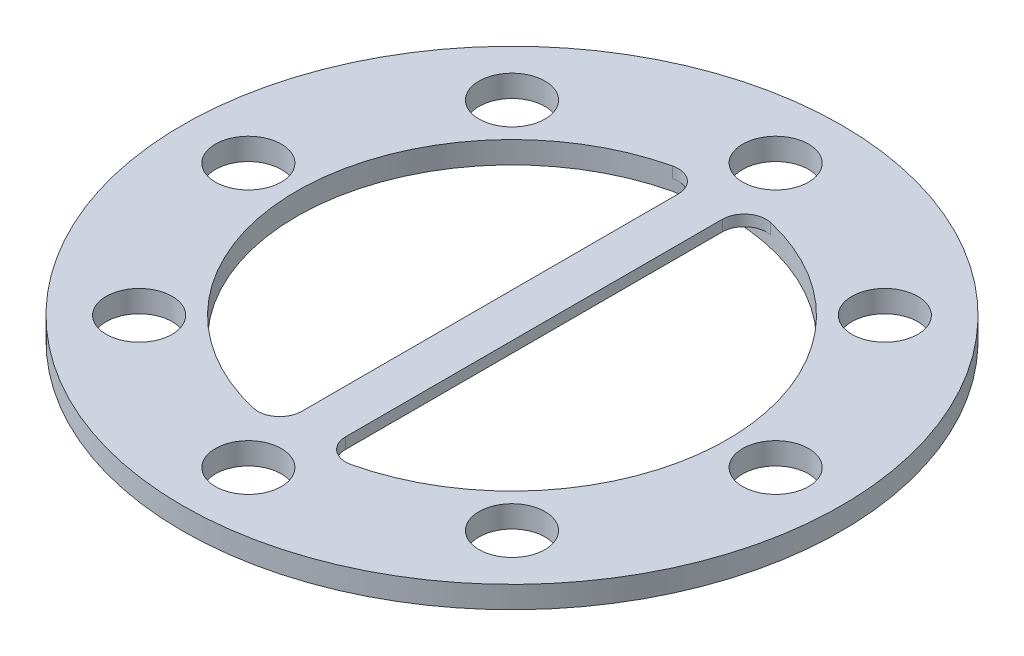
ISO-10303-21;
HEADER;
FILE_DESCRIPTION(('STEP AP214'),'2;1');
FILE_NAME('part.step','',(''),(''),'','','');
FILE_SCHEMA(('AUTOMOTIVE_DESIGN { 1 0 10303 214 1 1 1 1 }'));
ENDSEC;
DATA;
#1=APPLICATION_CONTEXT('core data for automotive mechanical design processes');
#2=APPLICATION_PROTOCOL_DEFINITION('international standard','automotive_design',2000,#1);
#3=PRODUCT_CONTEXT('',#1,'mechanical');
#4=PRODUCT('Part','Part','',(#3));
#5=PRODUCT_RELATED_PRODUCT_CATEGORY('part','',(#4));
#6=PRODUCT_DEFINITION_FORMATION('','',#4);
#7=PRODUCT_DEFINITION_CONTEXT('part definition',#1,'design');
#8=PRODUCT_DEFINITION('design','',#6,#7);
#9=PRODUCT_DEFINITION_SHAPE('','',#8);
#10=(LENGTH_UNIT() NAMED_UNIT(*) SI_UNIT(.MILLI.,.METRE.));
#11=(NAMED_UNIT(*) PLANE_ANGLE_UNIT() SI_UNIT($,.RADIAN.));
#12=(NAMED_UNIT(*) SI_UNIT($,.STERADIAN.) SOLID_ANGLE_UNIT());
#13=UNCERTAINTY_MEASURE_WITH_UNIT(LENGTH_MEASURE(1.E-05),#10,'distance_accuracy_value','');
#14=(GEOMETRIC_REPRESENTATION_CONTEXT(3) GLOBAL_UNCERTAINTY_ASSIGNED_CONTEXT((#13)) GLOBAL_UNIT_ASSIGNED_CONTEXT((#10,
#11,#12)) REPRESENTATION_CONTEXT('',''));
#15=CARTESIAN_POINT('',(0.,0.,0.));
#16=DIRECTION('',(0.,0.,1.));
#17=DIRECTION('',(1.,0.,0.));
#18=AXIS2_PLACEMENT_3D('',#15,#16,#17);
#19=CARTESIAN_POINT('',(0.,3.175,0.));
#20=DIRECTION('',(0.,-1.,0.));
#21=DIRECTION('',(0.,0.,-1.));
#22=AXIS2_PLACEMENT_3D('',#19,#20,#21);
#23=CYLINDRICAL_SURFACE('',#22,31.115);
#24=CARTESIAN_POINT('',(0.,1.5875,0.));
#25=DIRECTION('',(0.,1.,0.));
#26=DIRECTION('',(0.,0.,1.));
#27=AXIS2_PLACEMENT_3D('',#24,#25,#26);
#28=CIRCLE('',#27,31.115);
#29=CARTESIAN_POINT('',(7.07159090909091,1.5875,30.3007562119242));
#30=VERTEX_POINT('',#29);
#31=CARTESIAN_POINT('',(-7.07159090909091,1.5875,30.3007562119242));
#32=VERTEX_POINT('',#31);
#33=EDGE_CURVE('E156',#30,#32,#28,.F.);
#34=ORIENTED_EDGE('',*,*,#33,.F.);
#35=DIRECTION('',(0.,-1.,0.));
#36=VECTOR('',#35,1.);
#37=CARTESIAN_POINT('',(7.07159090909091,3.175,30.3007562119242));
#38=LINE('',#37,#36);
#39=CARTESIAN_POINT('',(7.07159090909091,3.175,30.3007562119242));
#40=VERTEX_POINT('',#39);
#41=EDGE_CURVE('E139',#30,#40,#38,.F.);
#42=ORIENTED_EDGE('',*,*,#41,.T.);
#43=CARTESIAN_POINT('',(0.,3.175,0.));
#44=DIRECTION('',(0.,1.,0.));
#45=DIRECTION('',(0.,0.,1.));
#46=AXIS2_PLACEMENT_3D('',#43,#44,#45);
#47=CIRCLE('',#46,31.115);
#48=CARTESIAN_POINT('',(7.07159090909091,3.175,-30.3007562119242));
#49=VERTEX_POINT('',#48);
#50=EDGE_CURVE('E153',#40,#49,#47,.T.);
#51=ORIENTED_EDGE('',*,*,#50,.T.);
#52=DIRECTION('',(0.,-1.,0.));
#53=VECTOR('',#52,1.);
#54=CARTESIAN_POINT('',(7.07159090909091,3.175,-30.3007562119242));
#55=LINE('',#54,#53);
#56=CARTESIAN_POINT('',(7.07159090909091,1.5875,-30.3007562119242));
#57=VERTEX_POINT('',#56);
#58=EDGE_CURVE('E171',#49,#57,#55,.T.);
#59=ORIENTED_EDGE('',*,*,#58,.T.);
#60=CARTESIAN_POINT('',(-7.07159090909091,1.5875,-30.3007562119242));
#61=VERTEX_POINT('',#60);
#62=EDGE_CURVE('E183',#61,#57,#28,.F.);
#63=ORIENTED_EDGE('',*,*,#62,.F.);
#64=DIRECTION('',(0.,-1.,0.));
#65=VECTOR('',#64,1.);
#66=CARTESIAN_POINT('',(-7.07159090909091,3.175,-30.3007562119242));
#67=LINE('',#66,#65);
#68=CARTESIAN_POINT('',(-7.07159090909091,3.175,-30.3007562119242));
#69=VERTEX_POINT('',#68);
#70=EDGE_CURVE('E222',#61,#69,#67,.F.);
#71=ORIENTED_EDGE('',*,*,#70,.T.);
#72=CARTESIAN_POINT('',(-7.07159090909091,3.175,30.3007562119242));
#73=VERTEX_POINT('',#72);
#74=EDGE_CURVE('E166',#69,#73,#47,.T.);
#75=ORIENTED_EDGE('',*,*,#74,.T.);
#76=DIRECTION('',(0.,-1.,0.));
#77=VECTOR('',#76,1.);
#78=CARTESIAN_POINT('',(-7.07159090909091,3.175,30.3007562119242));
#79=LINE('',#78,#77);
#80=EDGE_CURVE('E160',#73,#32,#79,.T.);
#81=ORIENTED_EDGE('',*,*,#80,.T.);
#82=EDGE_LOOP('',(#34,#42,#51,#59,#63,#71,#75,#81));
#83=FACE_BOUND('',#82,.T.);
#84=CARTESIAN_POINT('',(0.,0.,0.));
#85=DIRECTION('',(0.,1.,0.));
#86=DIRECTION('',(0.,0.,1.));
#87=AXIS2_PLACEMENT_3D('',#84,#85,#86);
#88=CIRCLE('',#87,31.115);
#89=CARTESIAN_POINT('',(0.,0.,31.115));
#90=VERTEX_POINT('',#89);
#91=EDGE_CURVE('E211',#90,#90,#88,.T.);
#92=ORIENTED_EDGE('',*,*,#91,.F.);
#93=EDGE_LOOP('',(#92));
#94=FACE_BOUND('',#93,.T.);
#95=ADVANCED_FACE('F69',(#83,#94),#23,.F.);
#96=CARTESIAN_POINT('',(-26.940768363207,3.175,-26.9407683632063));
#97=DIRECTION('',(0.,-1.,0.));
#98=DIRECTION('',(0.,0.,-1.));
#99=AXIS2_PLACEMENT_3D('',#96,#97,#98);
#100=CYLINDRICAL_SURFACE('',#99,4.76250000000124);
#101=CARTESIAN_POINT('',(-26.940768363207,3.175,-26.9407683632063));
#102=DIRECTION('',(0.,1.,0.));
#103=DIRECTION('',(0.,0.,1.));
#104=AXIS2_PLACEMENT_3D('',#101,#102,#103);
#105=CIRCLE('',#104,4.76250000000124);
#106=CARTESIAN_POINT('',(-26.940768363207,3.175,-22.1782683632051));
#107=VERTEX_POINT('',#106);
#108=EDGE_CURVE('E174',#107,#107,#105,.T.);
#109=ORIENTED_EDGE('',*,*,#108,.T.);
#110=EDGE_LOOP('',(#109));
#111=FACE_BOUND('',#110,.T.);
#112=CARTESIAN_POINT('',(-26.940768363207,0.,-26.9407683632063));
#113=DIRECTION('',(0.,1.,0.));
#114=DIRECTION('',(0.,0.,1.));
#115=AXIS2_PLACEMENT_3D('',#112,#113,#114);
#116=CIRCLE('',#115,4.76250000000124);
#117=CARTESIAN_POINT('',(-26.940768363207,0.,-22.1782683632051));
#118=VERTEX_POINT('',#117);
#119=EDGE_CURVE('E207',#118,#118,#116,.T.);
#120=ORIENTED_EDGE('',*,*,#119,.F.);
#121=EDGE_LOOP('',(#120));
#122=FACE_BOUND('',#121,.T.);
#123=ADVANCED_FACE('F308',(#111,#122),#100,.F.);
#124=CARTESIAN_POINT('',(0.,3.175,-38.1));
#125=DIRECTION('',(0.,-1.,0.));
#126=DIRECTION('',(0.,0.,-1.));
#127=AXIS2_PLACEMENT_3D('',#124,#125,#126);
#128=CYLINDRICAL_SURFACE('',#127,4.7625);
#129=CARTESIAN_POINT('',(0.,3.175,-38.1));
#130=DIRECTION('',(0.,1.,0.));
#131=DIRECTION('',(0.,0.,1.));
#132=AXIS2_PLACEMENT_3D('',#129,#130,#131);
#133=CIRCLE('',#132,4.7625);
#134=CARTESIAN_POINT('',(0.,3.175,-33.3375));
#135=VERTEX_POINT('',#134);
#136=EDGE_CURVE('E299',#135,#135,#133,.T.);
#137=ORIENTED_EDGE('',*,*,#136,.T.);
#138=EDGE_LOOP('',(#137));
#139=FACE_BOUND('',#138,.T.);
#140=CARTESIAN_POINT('',(0.,0.,-38.1));
#141=DIRECTION('',(0.,1.,0.));
#142=DIRECTION('',(0.,0.,1.));
#143=AXIS2_PLACEMENT_3D('',#140,#141,#142);
#144=CIRCLE('',#143,4.7625);
#145=CARTESIAN_POINT('',(0.,0.,-33.3375));
#146=VERTEX_POINT('',#145);
#147=EDGE_CURVE('E203',#146,#146,#144,.T.);
#148=ORIENTED_EDGE('',*,*,#147,.F.);
#149=EDGE_LOOP('',(#148));
#150=FACE_BOUND('',#149,.T.);
#151=ADVANCED_FACE('F331',(#139,#150),#128,.F.);
#152=CARTESIAN_POINT('',(26.9407683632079,3.175,-26.9407683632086));
#153=DIRECTION('',(0.,-1.,0.));
#154=DIRECTION('',(0.,0.,-1.));
#155=AXIS2_PLACEMENT_3D('',#152,#153,#154);
#156=CYLINDRICAL_SURFACE('',#155,4.76250000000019);
#157=CARTESIAN_POINT('',(26.9407683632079,3.175,-26.9407683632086));
#158=DIRECTION('',(0.,1.,0.));
#159=DIRECTION('',(0.,0.,1.));
#160=AXIS2_PLACEMENT_3D('',#157,#158,#159);
#161=CIRCLE('',#160,4.76250000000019);
#162=CARTESIAN_POINT('',(26.9407683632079,3.175,-22.1782683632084));
#163=VERTEX_POINT('',#162);
#164=EDGE_CURVE('E296',#163,#163,#161,.T.);
#165=ORIENTED_EDGE('',*,*,#164,.T.);
#166=EDGE_LOOP('',(#165));
#167=FACE_BOUND('',#166,.T.);
#168=CARTESIAN_POINT('',(26.9407683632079,0.,-26.9407683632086));
#169=DIRECTION('',(0.,1.,0.));
#170=DIRECTION('',(0.,0.,1.));
#171=AXIS2_PLACEMENT_3D('',#168,#169,#170);
#172=CIRCLE('',#171,4.76250000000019);
#173=CARTESIAN_POINT('',(26.9407683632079,0.,-22.1782683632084));
#174=VERTEX_POINT('',#173);
#175=EDGE_CURVE('E199',#174,#174,#172,.T.);
#176=ORIENTED_EDGE('',*,*,#175,.F.);
#177=EDGE_LOOP('',(#176));
#178=FACE_BOUND('',#177,.T.);
#179=ADVANCED_FACE('F336',(#167,#178),#156,.F.);
#180=CARTESIAN_POINT('',(38.1000000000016,3.175,-1.61730183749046E-12));
#181=DIRECTION('',(0.,-1.,0.));
#182=DIRECTION('',(0.,0.,-1.));
#183=AXIS2_PLACEMENT_3D('',#180,#181,#182);
#184=CYLINDRICAL_SURFACE('',#183,4.7625000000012);
#185=CARTESIAN_POINT('',(38.1000000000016,3.175,-1.61730183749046E-12));
#186=DIRECTION('',(0.,1.,0.));
#187=DIRECTION('',(0.,0.,1.));
#188=AXIS2_PLACEMENT_3D('',#185,#186,#187);
#189=CIRCLE('',#188,4.7625000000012);
#190=CARTESIAN_POINT('',(38.1000000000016,3.175,4.76249999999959));
#191=VERTEX_POINT('',#190);
#192=EDGE_CURVE('E292',#191,#191,#189,.T.);
#193=ORIENTED_EDGE('',*,*,#192,.T.);
#194=EDGE_LOOP('',(#193));
#195=FACE_BOUND('',#194,.T.);
#196=CARTESIAN_POINT('',(38.1000000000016,0.,-1.61730183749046E-12));
#197=DIRECTION('',(0.,1.,0.));
#198=DIRECTION('',(0.,0.,1.));
#199=AXIS2_PLACEMENT_3D('',#196,#197,#198);
#200=CIRCLE('',#199,4.7625000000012);
#201=CARTESIAN_POINT('',(38.1000000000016,0.,4.76249999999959));
#202=VERTEX_POINT('',#201);
#203=EDGE_CURVE('E195',#202,#202,#200,.T.);
#204=ORIENTED_EDGE('',*,*,#203,.F.);
#205=EDGE_LOOP('',(#204));
#206=FACE_BOUND('',#205,.T.);
#207=ADVANCED_FACE('F339',(#195,#206),#184,.F.);
#208=CARTESIAN_POINT('',(26.9407683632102,3.175,26.9407683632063));
#209=DIRECTION('',(0.,-1.,0.));
#210=DIRECTION('',(0.,0.,-1.));
#211=AXIS2_PLACEMENT_3D('',#208,#209,#210);
#212=CYLINDRICAL_SURFACE('',#211,4.7625000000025);
#213=CARTESIAN_POINT('',(26.9407683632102,3.175,26.9407683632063));
#214=DIRECTION('',(0.,1.,0.));
#215=DIRECTION('',(0.,0.,1.));
#216=AXIS2_PLACEMENT_3D('',#213,#214,#215);
#217=CIRCLE('',#216,4.7625000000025);
#218=CARTESIAN_POINT('',(26.9407683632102,3.175,31.7032683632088));
#219=VERTEX_POINT('',#218);
#220=EDGE_CURVE('E288',#219,#219,#217,.T.);
#221=ORIENTED_EDGE('',*,*,#220,.T.);
#222=EDGE_LOOP('',(#221));
#223=FACE_BOUND('',#222,.T.);
#224=CARTESIAN_POINT('',(26.9407683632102,0.,26.9407683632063));
#225=DIRECTION('',(0.,1.,0.));
#226=DIRECTION('',(0.,0.,1.));
#227=AXIS2_PLACEMENT_3D('',#224,#225,#226);
#228=CIRCLE('',#227,4.7625000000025);
#229=CARTESIAN_POINT('',(26.9407683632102,0.,31.7032683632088));
#230=VERTEX_POINT('',#229);
#231=EDGE_CURVE('E191',#230,#230,#228,.T.);
#232=ORIENTED_EDGE('',*,*,#231,.F.);
#233=EDGE_LOOP('',(#232));
#234=FACE_BOUND('',#233,.T.);
#235=ADVANCED_FACE('F343',(#223,#234),#212,.F.);
#236=CARTESIAN_POINT('',(3.23460367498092E-12,3.175,38.1));
#237=DIRECTION('',(0.,-1.,0.));
#238=DIRECTION('',(0.,0.,-1.));
#239=AXIS2_PLACEMENT_3D('',#236,#237,#238);
#240=CYLINDRICAL_SURFACE('',#239,4.76250000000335);
#241=CARTESIAN_POINT('',(3.23460367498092E-12,3.175,38.1));
#242=DIRECTION('',(0.,1.,0.));
#243=DIRECTION('',(0.,0.,1.));
#244=AXIS2_PLACEMENT_3D('',#241,#242,#243);
#245=CIRCLE('',#244,4.76250000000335);
#246=CARTESIAN_POINT('',(3.23460367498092E-12,3.175,42.8625000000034));
#247=VERTEX_POINT('',#246);
#248=EDGE_CURVE('E284',#247,#247,#245,.T.);
#249=ORIENTED_EDGE('',*,*,#248,.T.);
#250=EDGE_LOOP('',(#249));
#251=FACE_BOUND('',#250,.T.);
#252=CARTESIAN_POINT('',(3.23460367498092E-12,0.,38.1));
#253=DIRECTION('',(0.,1.,0.));
#254=DIRECTION('',(0.,0.,1.));
#255=AXIS2_PLACEMENT_3D('',#252,#253,#254);
#256=CIRCLE('',#255,4.76250000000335);
#257=CARTESIAN_POINT('',(3.23460367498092E-12,0.,42.8625000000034));
#258=VERTEX_POINT('',#257);
#259=EDGE_CURVE('E187',#258,#258,#256,.T.);
#260=ORIENTED_EDGE('',*,*,#259,.F.);
#261=EDGE_LOOP('',(#260));
#262=FACE_BOUND('',#261,.T.);
#263=ADVANCED_FACE('F347',(#251,#262),#240,.F.);
#264=CARTESIAN_POINT('',(-26.9407683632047,3.175,26.9407683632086));
#265=DIRECTION('',(0.,-1.,0.));
#266=DIRECTION('',(0.,0.,-1.));
#267=AXIS2_PLACEMENT_3D('',#264,#265,#266);
#268=CYLINDRICAL_SURFACE('',#267,4.76250000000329);
#269=CARTESIAN_POINT('',(-26.9407683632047,3.175,26.9407683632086));
#270=DIRECTION('',(0.,1.,0.));
#271=DIRECTION('',(0.,0.,1.));
#272=AXIS2_PLACEMENT_3D('',#269,#270,#271);
#273=CIRCLE('',#272,4.76250000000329);
#274=CARTESIAN_POINT('',(-26.9407683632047,3.175,31.7032683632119));
#275=VERTEX_POINT('',#274);
#276=EDGE_CURVE('E280',#275,#275,#273,.T.);
#277=ORIENTED_EDGE('',*,*,#276,.T.);
#278=EDGE_LOOP('',(#277));
#279=FACE_BOUND('',#278,.T.);
#280=CARTESIAN_POINT('',(-26.9407683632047,0.,26.9407683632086));
#281=DIRECTION('',(0.,1.,0.));
#282=DIRECTION('',(0.,0.,1.));
#283=AXIS2_PLACEMENT_3D('',#280,#281,#282);
#284=CIRCLE('',#283,4.76250000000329);
#285=CARTESIAN_POINT('',(-26.9407683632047,0.,31.7032683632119));
#286=VERTEX_POINT('',#285);
#287=EDGE_CURVE('E182',#286,#286,#284,.T.);
#288=ORIENTED_EDGE('',*,*,#287,.F.);
#289=EDGE_LOOP('',(#288));
#290=FACE_BOUND('',#289,.T.);
#291=ADVANCED_FACE('F351',(#279,#290),#268,.F.);
#292=CARTESIAN_POINT('',(-38.0999999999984,3.175,1.62196774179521E-12));
#293=DIRECTION('',(0.,-1.,0.));
#294=DIRECTION('',(0.,0.,-1.));
#295=AXIS2_PLACEMENT_3D('',#292,#293,#294);
#296=CYLINDRICAL_SURFACE('',#295,4.76250000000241);
#297=CARTESIAN_POINT('',(-38.0999999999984,3.175,1.62196774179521E-12));
#298=DIRECTION('',(0.,1.,0.));
#299=DIRECTION('',(0.,0.,1.));
#300=AXIS2_PLACEMENT_3D('',#297,#298,#299);
#301=CIRCLE('',#300,4.76250000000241);
#302=CARTESIAN_POINT('',(-38.0999999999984,3.175,4.76250000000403));
#303=VERTEX_POINT('',#302);
#304=EDGE_CURVE('E219',#303,#303,#301,.T.);
#305=ORIENTED_EDGE('',*,*,#304,.T.);
#306=EDGE_LOOP('',(#305));
#307=FACE_BOUND('',#306,.T.);
#308=CARTESIAN_POINT('',(-38.0999999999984,0.,1.62196774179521E-12));
#309=DIRECTION('',(0.,1.,0.));
#310=DIRECTION('',(0.,0.,1.));
#311=AXIS2_PLACEMENT_3D('',#308,#309,#310);
#312=CIRCLE('',#311,4.76250000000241);
#313=CARTESIAN_POINT('',(-38.0999999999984,0.,4.76250000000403));
#314=VERTEX_POINT('',#313);
#315=EDGE_CURVE('E178',#314,#314,#312,.T.);
#316=ORIENTED_EDGE('',*,*,#315,.F.);
#317=EDGE_LOOP('',(#316));
#318=FACE_BOUND('',#317,.T.);
#319=ADVANCED_FACE('F322',(#307,#318),#296,.F.);
#320=CARTESIAN_POINT('',(0.,3.175,0.));
#321=DIRECTION('',(0.,-1.,0.));
#322=DIRECTION('',(0.,0.,-1.));
#323=AXIS2_PLACEMENT_3D('',#320,#321,#322);
#324=CYLINDRICAL_SURFACE('',#323,47.625);
#325=CARTESIAN_POINT('',(0.,3.175,0.));
#326=DIRECTION('',(0.,1.,0.));
#327=DIRECTION('',(0.,0.,1.));
#328=AXIS2_PLACEMENT_3D('',#325,#326,#327);
#329=CIRCLE('',#328,47.625);
#330=CARTESIAN_POINT('',(0.,3.175,47.625));
#331=VERTEX_POINT('',#330);
#332=EDGE_CURVE('E165',#331,#331,#329,.T.);
#333=ORIENTED_EDGE('',*,*,#332,.F.);
#334=EDGE_LOOP('',(#333));
#335=FACE_BOUND('',#334,.T.);
#336=CARTESIAN_POINT('',(0.,0.,0.));
#337=DIRECTION('',(0.,1.,0.));
#338=DIRECTION('',(0.,0.,1.));
#339=AXIS2_PLACEMENT_3D('',#336,#337,#338);
#340=CIRCLE('',#339,47.625);
#341=CARTESIAN_POINT('',(0.,0.,47.625));
#342=VERTEX_POINT('',#341);
#343=EDGE_CURVE('E215',#342,#342,#340,.T.);
#344=ORIENTED_EDGE('',*,*,#343,.T.);
#345=EDGE_LOOP('',(#344));
#346=FACE_BOUND('',#345,.T.);
#347=ADVANCED_FACE('F313',(#335,#346),#324,.T.);
#348=CARTESIAN_POINT('',(0.,3.175,0.));
#349=DIRECTION('',(0.,1.,0.));
#350=DIRECTION('',(0.,0.,1.));
#351=AXIS2_PLACEMENT_3D('',#348,#349,#350);
#352=PLANE('',#351);
#353=ORIENTED_EDGE('',*,*,#50,.F.);
#354=CARTESIAN_POINT('',(6.35,3.175,27.2088423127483));
#355=DIRECTION('',(0.,1.,0.));
#356=DIRECTION('',(0.,0.,1.));
#357=AXIS2_PLACEMENT_3D('',#354,#355,#356);
#358=CIRCLE('',#357,3.175);
#359=CARTESIAN_POINT('',(3.175,3.175,27.2088423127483));
#360=VERTEX_POINT('',#359);
#361=EDGE_CURVE('E135',#40,#360,#358,.F.);
#362=ORIENTED_EDGE('',*,*,#361,.T.);
#363=DIRECTION('',(0.,0.,-1.));
#364=VECTOR('',#363,1.);
#365=CARTESIAN_POINT('',(3.175,3.175,0.));
#366=LINE('',#365,#364);
#367=CARTESIAN_POINT('',(3.175,3.175,-27.2088423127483));
#368=VERTEX_POINT('',#367);
#369=EDGE_CURVE('E269',#360,#368,#366,.T.);
#370=ORIENTED_EDGE('',*,*,#369,.T.);
#371=CARTESIAN_POINT('',(6.35,3.175,-27.2088423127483));
#372=DIRECTION('',(0.,1.,0.));
#373=DIRECTION('',(0.,0.,1.));
#374=AXIS2_PLACEMENT_3D('',#371,#372,#373);
#375=CIRCLE('',#374,3.175);
#376=EDGE_CURVE('E78',#368,#49,#375,.F.);
#377=ORIENTED_EDGE('',*,*,#376,.T.);
#378=EDGE_LOOP('',(#353,#362,#370,#377));
#379=FACE_BOUND('',#378,.T.);
#380=ORIENTED_EDGE('',*,*,#304,.F.);
#381=EDGE_LOOP('',(#380));
#382=FACE_BOUND('',#381,.T.);
#383=ORIENTED_EDGE('',*,*,#276,.F.);
#384=EDGE_LOOP('',(#383));
#385=FACE_BOUND('',#384,.T.);
#386=ORIENTED_EDGE('',*,*,#248,.F.);
#387=EDGE_LOOP('',(#386));
#388=FACE_BOUND('',#387,.T.);
#389=ORIENTED_EDGE('',*,*,#220,.F.);
#390=EDGE_LOOP('',(#389));
#391=FACE_BOUND('',#390,.T.);
#392=ORIENTED_EDGE('',*,*,#192,.F.);
#393=EDGE_LOOP('',(#392));
#394=FACE_BOUND('',#393,.T.);
#395=ORIENTED_EDGE('',*,*,#164,.F.);
#396=EDGE_LOOP('',(#395));
#397=FACE_BOUND('',#396,.T.);
#398=ORIENTED_EDGE('',*,*,#136,.F.);
#399=EDGE_LOOP('',(#398));
#400=FACE_BOUND('',#399,.T.);
#401=ORIENTED_EDGE('',*,*,#108,.F.);
#402=EDGE_LOOP('',(#401));
#403=FACE_BOUND('',#402,.T.);
#404=ORIENTED_EDGE('',*,*,#74,.F.);
#405=CARTESIAN_POINT('',(-6.35,3.175,-27.2088423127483));
#406=DIRECTION('',(0.,1.,0.));
#407=DIRECTION('',(0.,0.,1.));
#408=AXIS2_PLACEMENT_3D('',#405,#406,#407);
#409=CIRCLE('',#408,3.175);
#410=CARTESIAN_POINT('',(-3.175,3.175,-27.2088423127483));
#411=VERTEX_POINT('',#410);
#412=EDGE_CURVE('E245',#69,#411,#409,.F.);
#413=ORIENTED_EDGE('',*,*,#412,.T.);
#414=DIRECTION('',(0.,0.,-1.));
#415=VECTOR('',#414,1.);
#416=CARTESIAN_POINT('',(-3.175,3.175,30.952586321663));
#417=LINE('',#416,#415);
#418=CARTESIAN_POINT('',(-3.175,3.175,27.2088423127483));
#419=VERTEX_POINT('',#418);
#420=EDGE_CURVE('E263',#419,#411,#417,.T.);
#421=ORIENTED_EDGE('',*,*,#420,.F.);
#422=CARTESIAN_POINT('',(-6.35,3.175,27.2088423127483));
#423=DIRECTION('',(0.,1.,0.));
#424=DIRECTION('',(0.,0.,1.));
#425=AXIS2_PLACEMENT_3D('',#422,#423,#424);
#426=CIRCLE('',#425,3.175);
#427=EDGE_CURVE('E240',#419,#73,#426,.F.);
#428=ORIENTED_EDGE('',*,*,#427,.T.);
#429=EDGE_LOOP('',(#404,#413,#421,#428));
#430=FACE_BOUND('',#429,.T.);
#431=ORIENTED_EDGE('',*,*,#332,.T.);
#432=EDGE_LOOP('',(#431));
#433=FACE_BOUND('',#432,.T.);
#434=ADVANCED_FACE('F162',(#379,#382,#385,#388,#391,#394,#397,#400,#403,#430,#433),#352,.T.);
#435=CARTESIAN_POINT('',(0.,0.,0.));
#436=DIRECTION('',(0.,1.,0.));
#437=DIRECTION('',(0.,0.,1.));
#438=AXIS2_PLACEMENT_3D('',#435,#436,#437);
#439=PLANE('',#438);
#440=ORIENTED_EDGE('',*,*,#315,.T.);
#441=EDGE_LOOP('',(#440));
#442=FACE_BOUND('',#441,.T.);
#443=ORIENTED_EDGE('',*,*,#287,.T.);
#444=EDGE_LOOP('',(#443));
#445=FACE_BOUND('',#444,.T.);
#446=ORIENTED_EDGE('',*,*,#259,.T.);
#447=EDGE_LOOP('',(#446));
#448=FACE_BOUND('',#447,.T.);
#449=ORIENTED_EDGE('',*,*,#231,.T.);
#450=EDGE_LOOP('',(#449));
#451=FACE_BOUND('',#450,.T.);
#452=ORIENTED_EDGE('',*,*,#203,.T.);
#453=EDGE_LOOP('',(#452));
#454=FACE_BOUND('',#453,.T.);
#455=ORIENTED_EDGE('',*,*,#175,.T.);
#456=EDGE_LOOP('',(#455));
#457=FACE_BOUND('',#456,.T.);
#458=ORIENTED_EDGE('',*,*,#147,.T.);
#459=EDGE_LOOP('',(#458));
#460=FACE_BOUND('',#459,.T.);
#461=ORIENTED_EDGE('',*,*,#119,.T.);
#462=EDGE_LOOP('',(#461));
#463=FACE_BOUND('',#462,.T.);
#464=ORIENTED_EDGE('',*,*,#91,.T.);
#465=EDGE_LOOP('',(#464));
#466=FACE_BOUND('',#465,.T.);
#467=ORIENTED_EDGE('',*,*,#343,.F.);
#468=EDGE_LOOP('',(#467));
#469=FACE_BOUND('',#468,.T.);
#470=ADVANCED_FACE('F312',(#442,#445,#448,#451,#454,#457,#460,#463,#466,#469),#439,.F.);
#471=CARTESIAN_POINT('',(3.175,1.5875,0.));
#472=DIRECTION('',(1.,0.,0.));
#473=DIRECTION('',(0.,0.,-1.));
#474=AXIS2_PLACEMENT_3D('',#471,#472,#473);
#475=PLANE('',#474);
#476=ORIENTED_EDGE('',*,*,#369,.F.);
#477=DIRECTION('',(0.,1.,0.));
#478=VECTOR('',#477,1.);
#479=CARTESIAN_POINT('',(3.175,1.5875,27.2088423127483));
#480=LINE('',#479,#478);
#481=CARTESIAN_POINT('',(3.175,1.5875,27.2088423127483));
#482=VERTEX_POINT('',#481);
#483=EDGE_CURVE('E140',#360,#482,#480,.F.);
#484=ORIENTED_EDGE('',*,*,#483,.T.);
#485=DIRECTION('',(0.,0.,-1.));
#486=VECTOR('',#485,1.);
#487=CARTESIAN_POINT('',(3.175,1.5875,0.));
#488=LINE('',#487,#486);
#489=CARTESIAN_POINT('',(3.175,1.5875,-27.2088423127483));
#490=VERTEX_POINT('',#489);
#491=EDGE_CURVE('E373',#482,#490,#488,.T.);
#492=ORIENTED_EDGE('',*,*,#491,.T.);
#493=DIRECTION('',(0.,1.,0.));
#494=VECTOR('',#493,1.);
#495=CARTESIAN_POINT('',(3.175,3.175,-27.2088423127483));
#496=LINE('',#495,#494);
#497=EDGE_CURVE('E159',#490,#368,#496,.T.);
#498=ORIENTED_EDGE('',*,*,#497,.T.);
#499=EDGE_LOOP('',(#476,#484,#492,#498));
#500=FACE_BOUND('',#499,.T.);
#501=ADVANCED_FACE('F319',(#500),#475,.T.);
#502=CARTESIAN_POINT('',(0.,1.5875,0.));
#503=DIRECTION('',(0.,1.,0.));
#504=DIRECTION('',(0.,0.,1.));
#505=AXIS2_PLACEMENT_3D('',#502,#503,#504);
#506=PLANE('',#505);
#507=ORIENTED_EDGE('',*,*,#33,.T.);
#508=CARTESIAN_POINT('',(-6.35,1.5875,27.2088423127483));
#509=DIRECTION('',(0.,1.,0.));
#510=DIRECTION('',(0.,0.,1.));
#511=AXIS2_PLACEMENT_3D('',#508,#509,#510);
#512=CIRCLE('',#511,3.175);
#513=CARTESIAN_POINT('',(-3.175,1.5875,27.2088423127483));
#514=VERTEX_POINT('',#513);
#515=EDGE_CURVE('E92',#32,#514,#512,.T.);
#516=ORIENTED_EDGE('',*,*,#515,.T.);
#517=DIRECTION('',(0.,0.,-1.));
#518=VECTOR('',#517,1.);
#519=CARTESIAN_POINT('',(-3.175,1.5875,30.952586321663));
#520=LINE('',#519,#518);
#521=CARTESIAN_POINT('',(-3.175,1.5875,-27.2088423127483));
#522=VERTEX_POINT('',#521);
#523=EDGE_CURVE('E255',#514,#522,#520,.T.);
#524=ORIENTED_EDGE('',*,*,#523,.T.);
#525=CARTESIAN_POINT('',(-6.35,1.5875,-27.2088423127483));
#526=DIRECTION('',(0.,1.,0.));
#527=DIRECTION('',(0.,0.,1.));
#528=AXIS2_PLACEMENT_3D('',#525,#526,#527);
#529=CIRCLE('',#528,3.175);
#530=EDGE_CURVE('E248',#522,#61,#529,.T.);
#531=ORIENTED_EDGE('',*,*,#530,.T.);
#532=ORIENTED_EDGE('',*,*,#62,.T.);
#533=CARTESIAN_POINT('',(6.35,1.5875,-27.2088423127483));
#534=DIRECTION('',(0.,1.,0.));
#535=DIRECTION('',(0.,0.,1.));
#536=AXIS2_PLACEMENT_3D('',#533,#534,#535);
#537=CIRCLE('',#536,3.175);
#538=EDGE_CURVE('E12',#57,#490,#537,.T.);
#539=ORIENTED_EDGE('',*,*,#538,.T.);
#540=ORIENTED_EDGE('',*,*,#491,.F.);
#541=CARTESIAN_POINT('',(6.35,1.5875,27.2088423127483));
#542=DIRECTION('',(0.,1.,0.));
#543=DIRECTION('',(0.,0.,1.));
#544=AXIS2_PLACEMENT_3D('',#541,#542,#543);
#545=CIRCLE('',#544,3.175);
#546=EDGE_CURVE('E146',#482,#30,#545,.T.);
#547=ORIENTED_EDGE('',*,*,#546,.T.);
#548=EDGE_LOOP('',(#507,#516,#524,#531,#532,#539,#540,#547));
#549=FACE_BOUND('',#548,.T.);
#550=ADVANCED_FACE('F254',(#549),#506,.F.);
#551=CARTESIAN_POINT('',(-3.175,1.5875,30.952586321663));
#552=DIRECTION('',(1.,0.,0.));
#553=DIRECTION('',(0.,0.,-1.));
#554=AXIS2_PLACEMENT_3D('',#551,#552,#553);
#555=PLANE('',#554);
#556=ORIENTED_EDGE('',*,*,#523,.F.);
#557=DIRECTION('',(0.,-1.,0.));
#558=VECTOR('',#557,1.);
#559=CARTESIAN_POINT('',(-3.175,1.5875,27.2088423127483));
#560=LINE('',#559,#558);
#561=EDGE_CURVE('E147',#514,#419,#560,.F.);
#562=ORIENTED_EDGE('',*,*,#561,.T.);
#563=ORIENTED_EDGE('',*,*,#420,.T.);
#564=DIRECTION('',(0.,-1.,0.));
#565=VECTOR('',#564,1.);
#566=CARTESIAN_POINT('',(-3.175,1.5875,-27.2088423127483));
#567=LINE('',#566,#565);
#568=EDGE_CURVE('E85',#411,#522,#567,.T.);
#569=ORIENTED_EDGE('',*,*,#568,.T.);
#570=EDGE_LOOP('',(#556,#562,#563,#569));
#571=FACE_BOUND('',#570,.T.);
#572=ADVANCED_FACE('F267',(#571),#555,.F.);
#573=CARTESIAN_POINT('',(6.35,3.175,27.2088423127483));
#574=DIRECTION('',(0.,-1.,0.));
#575=DIRECTION('',(0.,0.,-1.));
#576=AXIS2_PLACEMENT_3D('',#573,#574,#575);
#577=CYLINDRICAL_SURFACE('',#576,3.175);
#578=ORIENTED_EDGE('',*,*,#546,.F.);
#579=ORIENTED_EDGE('',*,*,#483,.F.);
#580=ORIENTED_EDGE('',*,*,#361,.F.);
#581=ORIENTED_EDGE('',*,*,#41,.F.);
#582=EDGE_LOOP('',(#578,#579,#580,#581));
#583=FACE_BOUND('',#582,.T.);
#584=ADVANCED_FACE('F138',(#583),#577,.F.);
#585=CARTESIAN_POINT('',(-6.35,3.175,27.2088423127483));
#586=DIRECTION('',(0.,-1.,0.));
#587=DIRECTION('',(0.,0.,-1.));
#588=AXIS2_PLACEMENT_3D('',#585,#586,#587);
#589=CYLINDRICAL_SURFACE('',#588,3.175);
#590=ORIENTED_EDGE('',*,*,#515,.F.);
#591=ORIENTED_EDGE('',*,*,#80,.F.);
#592=ORIENTED_EDGE('',*,*,#427,.F.);
#593=ORIENTED_EDGE('',*,*,#561,.F.);
#594=EDGE_LOOP('',(#590,#591,#592,#593));
#595=FACE_BOUND('',#594,.T.);
#596=ADVANCED_FACE('F266',(#595),#589,.F.);
#597=CARTESIAN_POINT('',(-6.35,3.175,-27.2088423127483));
#598=DIRECTION('',(0.,-1.,0.));
#599=DIRECTION('',(0.,0.,-1.));
#600=AXIS2_PLACEMENT_3D('',#597,#598,#599);
#601=CYLINDRICAL_SURFACE('',#600,3.175);
#602=ORIENTED_EDGE('',*,*,#530,.F.);
#603=ORIENTED_EDGE('',*,*,#568,.F.);
#604=ORIENTED_EDGE('',*,*,#412,.F.);
#605=ORIENTED_EDGE('',*,*,#70,.F.);
#606=EDGE_LOOP('',(#602,#603,#604,#605));
#607=FACE_BOUND('',#606,.T.);
#608=ADVANCED_FACE('F257',(#607),#601,.F.);
#609=CARTESIAN_POINT('',(6.35,3.175,-27.2088423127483));
#610=DIRECTION('',(0.,-1.,0.));
#611=DIRECTION('',(0.,0.,-1.));
#612=AXIS2_PLACEMENT_3D('',#609,#610,#611);
#613=CYLINDRICAL_SURFACE('',#612,3.175);
#614=ORIENTED_EDGE('',*,*,#538,.F.);
#615=ORIENTED_EDGE('',*,*,#58,.F.);
#616=ORIENTED_EDGE('',*,*,#376,.F.);
#617=ORIENTED_EDGE('',*,*,#497,.F.);
#618=EDGE_LOOP('',(#614,#615,#616,#617));
#619=FACE_BOUND('',#618,.T.);
#620=ADVANCED_FACE('F71',(#619),#613,.F.);
#621=CLOSED_SHELL('',(#95,#123,#151,#179,#207,#235,#263,#291,#319,#347,#434,#470,#501,#550,#572,
#584,#596,#608,#620));
#622=MANIFOLD_SOLID_BREP('B2',#621);
#623=ADVANCED_BREP_SHAPE_REPRESENTATION('',(#18,#622),#14);
#624=SHAPE_DEFINITION_REPRESENTATION(#9,#623);
ENDSEC;
END-ISO-10303-21;
